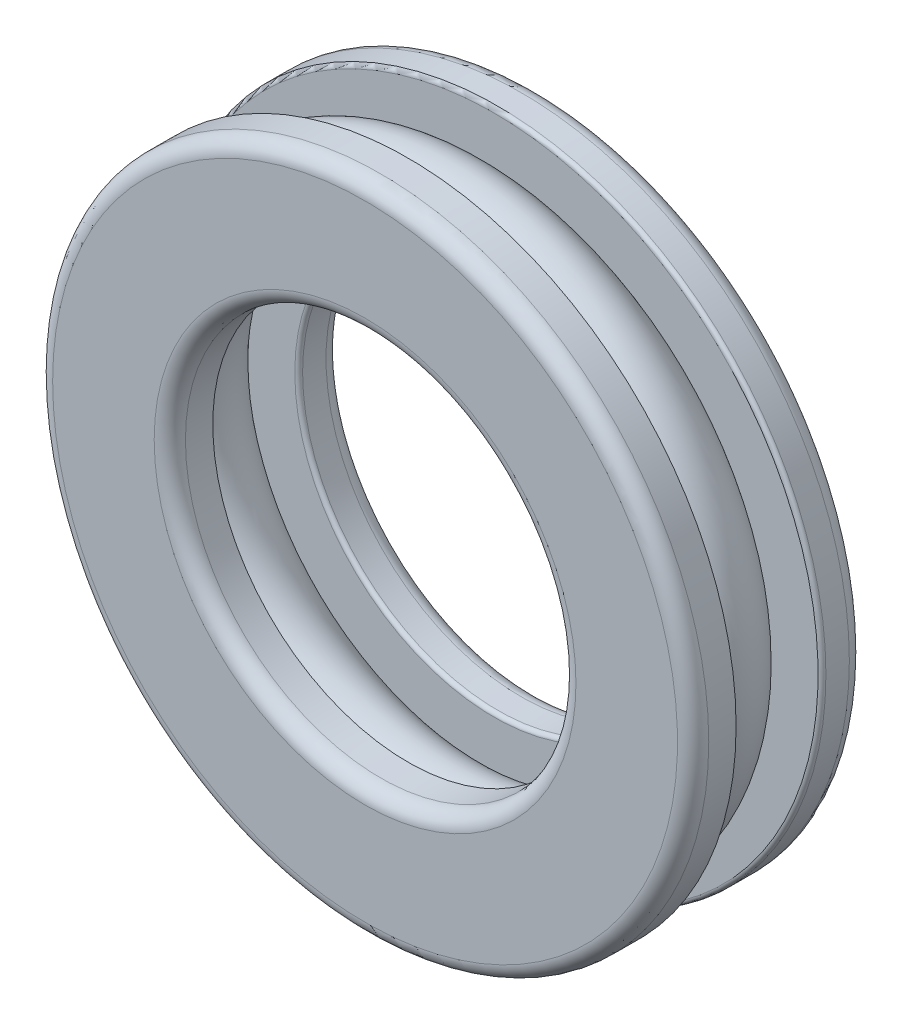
ISO-10303-21;
HEADER;
FILE_DESCRIPTION(('STEP AP214'),'2;1');
FILE_NAME('part.step','',(''),(''),'','','');
FILE_SCHEMA(('AUTOMOTIVE_DESIGN { 1 0 10303 214 1 1 1 1 }'));
ENDSEC;
DATA;
#1=APPLICATION_CONTEXT('core data for automotive mechanical design processes');
#2=APPLICATION_PROTOCOL_DEFINITION('international standard','automotive_design',2000,#1);
#3=PRODUCT_CONTEXT('',#1,'mechanical');
#4=PRODUCT('Part','Part','',(#3));
#5=PRODUCT_RELATED_PRODUCT_CATEGORY('part','',(#4));
#6=PRODUCT_DEFINITION_FORMATION('','',#4);
#7=PRODUCT_DEFINITION_CONTEXT('part definition',#1,'design');
#8=PRODUCT_DEFINITION('design','',#6,#7);
#9=PRODUCT_DEFINITION_SHAPE('','',#8);
#10=(LENGTH_UNIT() NAMED_UNIT(*) SI_UNIT(.MILLI.,.METRE.));
#11=(NAMED_UNIT(*) PLANE_ANGLE_UNIT() SI_UNIT($,.RADIAN.));
#12=(NAMED_UNIT(*) SI_UNIT($,.STERADIAN.) SOLID_ANGLE_UNIT());
#13=UNCERTAINTY_MEASURE_WITH_UNIT(LENGTH_MEASURE(1.E-05),#10,'distance_accuracy_value','');
#14=(GEOMETRIC_REPRESENTATION_CONTEXT(3) GLOBAL_UNCERTAINTY_ASSIGNED_CONTEXT((#13)) GLOBAL_UNIT_ASSIGNED_CONTEXT((#10,
#11,#12)) REPRESENTATION_CONTEXT('',''));
#15=CARTESIAN_POINT('',(0.,0.,0.));
#16=DIRECTION('',(0.,0.,1.));
#17=DIRECTION('',(1.,0.,0.));
#18=AXIS2_PLACEMENT_3D('',#15,#16,#17);
#19=CARTESIAN_POINT('',(0.,0.,-5.5));
#20=DIRECTION('',(0.,0.,1.));
#21=DIRECTION('',(1.,0.,0.));
#22=AXIS2_PLACEMENT_3D('',#19,#20,#21);
#23=TOROIDAL_SURFACE('',#22,16.75,2.65);
#24=CARTESIAN_POINT('',(19.4,0.,-5.5));
#25=VERTEX_POINT('',#24);
#26=VERTEX_LOOP('',#25);
#27=FACE_BOUND('',#26,.T.);
#28=ADVANCED_FACE('F39',(#27),#23,.T.);
#29=CLOSED_SHELL('',(#28));
#30=MANIFOLD_SOLID_BREP('B2',#29);
#31=CARTESIAN_POINT('',(0.,0.,0.));
#32=DIRECTION('',(0.,0.,1.));
#33=DIRECTION('',(1.,0.,0.));
#34=AXIS2_PLACEMENT_3D('',#31,#32,#33);
#35=CYLINDRICAL_SURFACE('',#34,21.);
#36=CARTESIAN_POINT('',(0.,0.,-8.5));
#37=DIRECTION('',(0.,0.,-1.));
#38=DIRECTION('',(-1.,0.,0.));
#39=AXIS2_PLACEMENT_3D('',#36,#37,#38);
#40=CIRCLE('',#39,21.);
#41=CARTESIAN_POINT('',(-21.,0.,-8.5));
#42=VERTEX_POINT('',#41);
#43=EDGE_CURVE('E66',#42,#42,#40,.T.);
#44=ORIENTED_EDGE('',*,*,#43,.T.);
#45=EDGE_LOOP('',(#44));
#46=FACE_BOUND('',#45,.T.);
#47=CARTESIAN_POINT('',(0.,0.,-10.));
#48=DIRECTION('',(0.,0.,1.));
#49=DIRECTION('',(1.,0.,0.));
#50=AXIS2_PLACEMENT_3D('',#47,#48,#49);
#51=CIRCLE('',#50,21.);
#52=CARTESIAN_POINT('',(21.,0.,-10.));
#53=VERTEX_POINT('',#52);
#54=EDGE_CURVE('E79',#53,#53,#51,.T.);
#55=ORIENTED_EDGE('',*,*,#54,.T.);
#56=EDGE_LOOP('',(#55));
#57=FACE_BOUND('',#56,.T.);
#58=ADVANCED_FACE('F59',(#46,#57),#35,.T.);
#59=CARTESIAN_POINT('',(-21.,0.,-8.25));
#60=DIRECTION('',(0.,0.,-1.));
#61=DIRECTION('',(-1.,0.,0.));
#62=AXIS2_PLACEMENT_3D('',#59,#60,#61);
#63=PLANE('',#62);
#64=CARTESIAN_POINT('',(0.,0.,-8.25));
#65=DIRECTION('',(0.,0.,-1.));
#66=DIRECTION('',(-1.,0.,0.));
#67=AXIS2_PLACEMENT_3D('',#64,#65,#66);
#68=CIRCLE('',#67,20.75);
#69=CARTESIAN_POINT('',(-20.75,0.,-8.25));
#70=VERTEX_POINT('',#69);
#71=EDGE_CURVE('E70',#70,#70,#68,.F.);
#72=ORIENTED_EDGE('',*,*,#71,.T.);
#73=EDGE_LOOP('',(#72));
#74=FACE_BOUND('',#73,.T.);
#75=CARTESIAN_POINT('',(0.,0.,-8.25));
#76=DIRECTION('',(0.,0.,-1.));
#77=DIRECTION('',(-1.,0.,0.));
#78=AXIS2_PLACEMENT_3D('',#75,#76,#77);
#79=CIRCLE('',#78,12.75);
#80=CARTESIAN_POINT('',(-12.75,0.,-8.25));
#81=VERTEX_POINT('',#80);
#82=EDGE_CURVE('E74',#81,#81,#79,.T.);
#83=ORIENTED_EDGE('',*,*,#82,.T.);
#84=EDGE_LOOP('',(#83));
#85=FACE_BOUND('',#84,.T.);
#86=ADVANCED_FACE('F103',(#74,#85),#63,.F.);
#87=CARTESIAN_POINT('',(0.,0.,0.));
#88=DIRECTION('',(0.,0.,1.));
#89=DIRECTION('',(1.,0.,0.));
#90=AXIS2_PLACEMENT_3D('',#87,#88,#89);
#91=CYLINDRICAL_SURFACE('',#90,12.5);
#92=CARTESIAN_POINT('',(0.,0.,-8.5));
#93=DIRECTION('',(0.,0.,-1.));
#94=DIRECTION('',(-1.,0.,0.));
#95=AXIS2_PLACEMENT_3D('',#92,#93,#94);
#96=CIRCLE('',#95,12.5);
#97=CARTESIAN_POINT('',(-12.5,0.,-8.5));
#98=VERTEX_POINT('',#97);
#99=EDGE_CURVE('E38',#98,#98,#96,.F.);
#100=ORIENTED_EDGE('',*,*,#99,.T.);
#101=EDGE_LOOP('',(#100));
#102=FACE_BOUND('',#101,.T.);
#103=CARTESIAN_POINT('',(0.,0.,-10.));
#104=DIRECTION('',(0.,0.,1.));
#105=DIRECTION('',(1.,0.,0.));
#106=AXIS2_PLACEMENT_3D('',#103,#104,#105);
#107=CIRCLE('',#106,12.5);
#108=CARTESIAN_POINT('',(12.5,0.,-10.));
#109=VERTEX_POINT('',#108);
#110=EDGE_CURVE('E82',#109,#109,#107,.F.);
#111=ORIENTED_EDGE('',*,*,#110,.T.);
#112=EDGE_LOOP('',(#111));
#113=FACE_BOUND('',#112,.T.);
#114=ADVANCED_FACE('F109',(#102,#113),#91,.F.);
#115=CARTESIAN_POINT('',(-21.,0.,-11.));
#116=DIRECTION('',(0.,0.,1.));
#117=DIRECTION('',(1.,0.,0.));
#118=AXIS2_PLACEMENT_3D('',#115,#116,#117);
#119=PLANE('',#118);
#120=CARTESIAN_POINT('',(0.,0.,-11.));
#121=DIRECTION('',(0.,0.,1.));
#122=DIRECTION('',(1.,0.,0.));
#123=AXIS2_PLACEMENT_3D('',#120,#121,#122);
#124=CIRCLE('',#123,13.5);
#125=CARTESIAN_POINT('',(13.5,0.,-11.));
#126=VERTEX_POINT('',#125);
#127=EDGE_CURVE('E85',#126,#126,#124,.T.);
#128=ORIENTED_EDGE('',*,*,#127,.T.);
#129=EDGE_LOOP('',(#128));
#130=FACE_BOUND('',#129,.T.);
#131=CARTESIAN_POINT('',(0.,0.,-11.));
#132=DIRECTION('',(0.,0.,1.));
#133=DIRECTION('',(1.,0.,0.));
#134=AXIS2_PLACEMENT_3D('',#131,#132,#133);
#135=CIRCLE('',#134,20.);
#136=CARTESIAN_POINT('',(20.,0.,-11.));
#137=VERTEX_POINT('',#136);
#138=EDGE_CURVE('E88',#137,#137,#135,.F.);
#139=ORIENTED_EDGE('',*,*,#138,.T.);
#140=EDGE_LOOP('',(#139));
#141=FACE_BOUND('',#140,.T.);
#142=ADVANCED_FACE('F92',(#130,#141),#119,.F.);
#143=CARTESIAN_POINT('',(0.,0.,-10.));
#144=DIRECTION('',(0.,0.,1.));
#145=DIRECTION('',(1.,0.,0.));
#146=AXIS2_PLACEMENT_3D('',#143,#144,#145);
#147=TOROIDAL_SURFACE('',#146,13.5,1.);
#148=ORIENTED_EDGE('',*,*,#110,.F.);
#149=EDGE_LOOP('',(#148));
#150=FACE_BOUND('',#149,.T.);
#151=ORIENTED_EDGE('',*,*,#127,.F.);
#152=EDGE_LOOP('',(#151));
#153=FACE_BOUND('',#152,.T.);
#154=ADVANCED_FACE('F98',(#150,#153),#147,.T.);
#155=CARTESIAN_POINT('',(0.,0.,-10.));
#156=DIRECTION('',(0.,0.,1.));
#157=DIRECTION('',(1.,0.,0.));
#158=AXIS2_PLACEMENT_3D('',#155,#156,#157);
#159=TOROIDAL_SURFACE('',#158,20.,1.);
#160=ORIENTED_EDGE('',*,*,#138,.F.);
#161=EDGE_LOOP('',(#160));
#162=FACE_BOUND('',#161,.T.);
#163=ORIENTED_EDGE('',*,*,#54,.F.);
#164=EDGE_LOOP('',(#163));
#165=FACE_BOUND('',#164,.T.);
#166=ADVANCED_FACE('F94',(#162,#165),#159,.T.);
#167=CARTESIAN_POINT('',(0.,0.,-8.5));
#168=DIRECTION('',(0.,0.,-1.));
#169=DIRECTION('',(-1.,0.,0.));
#170=AXIS2_PLACEMENT_3D('',#167,#168,#169);
#171=TOROIDAL_SURFACE('',#170,20.75,0.25);
#172=ORIENTED_EDGE('',*,*,#43,.F.);
#173=EDGE_LOOP('',(#172));
#174=FACE_BOUND('',#173,.T.);
#175=ORIENTED_EDGE('',*,*,#71,.F.);
#176=EDGE_LOOP('',(#175));
#177=FACE_BOUND('',#176,.T.);
#178=ADVANCED_FACE('F97',(#174,#177),#171,.T.);
#179=CARTESIAN_POINT('',(0.,0.,-8.5));
#180=DIRECTION('',(0.,0.,-1.));
#181=DIRECTION('',(-1.,0.,0.));
#182=AXIS2_PLACEMENT_3D('',#179,#180,#181);
#183=TOROIDAL_SURFACE('',#182,12.75,0.25);
#184=ORIENTED_EDGE('',*,*,#82,.F.);
#185=EDGE_LOOP('',(#184));
#186=FACE_BOUND('',#185,.T.);
#187=ORIENTED_EDGE('',*,*,#99,.F.);
#188=EDGE_LOOP('',(#187));
#189=FACE_BOUND('',#188,.T.);
#190=ADVANCED_FACE('F61',(#186,#189),#183,.T.);
#191=CLOSED_SHELL('',(#58,#86,#114,#142,#154,#166,#178,#190));
#192=MANIFOLD_SOLID_BREP('B6',#191);
#193=CARTESIAN_POINT('',(0.,0.,0.));
#194=DIRECTION('',(0.,0.,1.));
#195=DIRECTION('',(1.,0.,0.));
#196=AXIS2_PLACEMENT_3D('',#193,#194,#195);
#197=CYLINDRICAL_SURFACE('',#196,21.);
#198=CARTESIAN_POINT('',(0.,0.,-1.));
#199=DIRECTION('',(0.,0.,-1.));
#200=DIRECTION('',(-1.,0.,0.));
#201=AXIS2_PLACEMENT_3D('',#198,#199,#200);
#202=CIRCLE('',#201,21.);
#203=CARTESIAN_POINT('',(-21.,0.,-1.));
#204=VERTEX_POINT('',#203);
#205=EDGE_CURVE('E187',#204,#204,#202,.T.);
#206=ORIENTED_EDGE('',*,*,#205,.T.);
#207=EDGE_LOOP('',(#206));
#208=FACE_BOUND('',#207,.T.);
#209=CARTESIAN_POINT('',(0.,0.,-2.75));
#210=DIRECTION('',(0.,0.,1.));
#211=DIRECTION('',(1.,0.,0.));
#212=AXIS2_PLACEMENT_3D('',#209,#210,#211);
#213=CIRCLE('',#212,21.);
#214=CARTESIAN_POINT('',(21.,0.,-2.75));
#215=VERTEX_POINT('',#214);
#216=EDGE_CURVE('E200',#215,#215,#213,.T.);
#217=ORIENTED_EDGE('',*,*,#216,.T.);
#218=EDGE_LOOP('',(#217));
#219=FACE_BOUND('',#218,.T.);
#220=ADVANCED_FACE('F180',(#208,#219),#197,.T.);
#221=CARTESIAN_POINT('',(-21.,0.,-2.75));
#222=DIRECTION('',(0.,0.,1.));
#223=DIRECTION('',(1.,0.,0.));
#224=AXIS2_PLACEMENT_3D('',#221,#222,#223);
#225=PLANE('',#224);
#226=ORIENTED_EDGE('',*,*,#216,.F.);
#227=EDGE_LOOP('',(#226));
#228=FACE_BOUND('',#227,.T.);
#229=CARTESIAN_POINT('',(0.,0.,-2.75));
#230=DIRECTION('',(0.,0.,1.));
#231=DIRECTION('',(1.,0.,0.));
#232=AXIS2_PLACEMENT_3D('',#229,#230,#231);
#233=CIRCLE('',#232,12.5);
#234=CARTESIAN_POINT('',(12.5,0.,-2.75));
#235=VERTEX_POINT('',#234);
#236=EDGE_CURVE('E203',#235,#235,#233,.T.);
#237=ORIENTED_EDGE('',*,*,#236,.T.);
#238=EDGE_LOOP('',(#237));
#239=FACE_BOUND('',#238,.T.);
#240=ADVANCED_FACE('F207',(#228,#239),#225,.F.);
#241=CARTESIAN_POINT('',(0.,0.,0.));
#242=DIRECTION('',(0.,0.,1.));
#243=DIRECTION('',(1.,0.,0.));
#244=AXIS2_PLACEMENT_3D('',#241,#242,#243);
#245=CYLINDRICAL_SURFACE('',#244,12.5);
#246=CARTESIAN_POINT('',(0.,0.,-1.));
#247=DIRECTION('',(0.,0.,-1.));
#248=DIRECTION('',(-1.,0.,0.));
#249=AXIS2_PLACEMENT_3D('',#246,#247,#248);
#250=CIRCLE('',#249,12.5);
#251=CARTESIAN_POINT('',(-12.5,0.,-1.));
#252=VERTEX_POINT('',#251);
#253=EDGE_CURVE('E58',#252,#252,#250,.F.);
#254=ORIENTED_EDGE('',*,*,#253,.T.);
#255=EDGE_LOOP('',(#254));
#256=FACE_BOUND('',#255,.T.);
#257=ORIENTED_EDGE('',*,*,#236,.F.);
#258=EDGE_LOOP('',(#257));
#259=FACE_BOUND('',#258,.T.);
#260=ADVANCED_FACE('F209',(#256,#259),#245,.F.);
#261=CARTESIAN_POINT('',(-21.,0.,0.));
#262=DIRECTION('',(0.,0.,-1.));
#263=DIRECTION('',(-1.,0.,0.));
#264=AXIS2_PLACEMENT_3D('',#261,#262,#263);
#265=PLANE('',#264);
#266=CARTESIAN_POINT('',(0.,0.,0.));
#267=DIRECTION('',(0.,0.,-1.));
#268=DIRECTION('',(-1.,0.,0.));
#269=AXIS2_PLACEMENT_3D('',#266,#267,#268);
#270=CIRCLE('',#269,20.);
#271=CARTESIAN_POINT('',(-20.,0.,0.));
#272=VERTEX_POINT('',#271);
#273=EDGE_CURVE('E191',#272,#272,#270,.F.);
#274=ORIENTED_EDGE('',*,*,#273,.T.);
#275=EDGE_LOOP('',(#274));
#276=FACE_BOUND('',#275,.T.);
#277=CARTESIAN_POINT('',(0.,0.,0.));
#278=DIRECTION('',(0.,0.,-1.));
#279=DIRECTION('',(-1.,0.,0.));
#280=AXIS2_PLACEMENT_3D('',#277,#278,#279);
#281=CIRCLE('',#280,13.5);
#282=CARTESIAN_POINT('',(-13.5,0.,0.));
#283=VERTEX_POINT('',#282);
#284=EDGE_CURVE('E195',#283,#283,#281,.T.);
#285=ORIENTED_EDGE('',*,*,#284,.T.);
#286=EDGE_LOOP('',(#285));
#287=FACE_BOUND('',#286,.T.);
#288=ADVANCED_FACE('F211',(#276,#287),#265,.F.);
#289=CARTESIAN_POINT('',(0.,0.,-1.));
#290=DIRECTION('',(0.,0.,-1.));
#291=DIRECTION('',(-1.,0.,0.));
#292=AXIS2_PLACEMENT_3D('',#289,#290,#291);
#293=TOROIDAL_SURFACE('',#292,20.,1.);
#294=ORIENTED_EDGE('',*,*,#205,.F.);
#295=EDGE_LOOP('',(#294));
#296=FACE_BOUND('',#295,.T.);
#297=ORIENTED_EDGE('',*,*,#273,.F.);
#298=EDGE_LOOP('',(#297));
#299=FACE_BOUND('',#298,.T.);
#300=ADVANCED_FACE('F217',(#296,#299),#293,.T.);
#301=CARTESIAN_POINT('',(0.,0.,-1.));
#302=DIRECTION('',(0.,0.,-1.));
#303=DIRECTION('',(-1.,0.,0.));
#304=AXIS2_PLACEMENT_3D('',#301,#302,#303);
#305=TOROIDAL_SURFACE('',#304,13.5,1.);
#306=ORIENTED_EDGE('',*,*,#284,.F.);
#307=EDGE_LOOP('',(#306));
#308=FACE_BOUND('',#307,.T.);
#309=ORIENTED_EDGE('',*,*,#253,.F.);
#310=EDGE_LOOP('',(#309));
#311=FACE_BOUND('',#310,.T.);
#312=ADVANCED_FACE('F182',(#308,#311),#305,.T.);
#313=CLOSED_SHELL('',(#220,#240,#260,#288,#300,#312));
#314=MANIFOLD_SOLID_BREP('B33',#313);
#315=ADVANCED_BREP_SHAPE_REPRESENTATION('',(#18,#30,#192,#314),#14);
#316=SHAPE_DEFINITION_REPRESENTATION(#9,#315);
ENDSEC;
END-ISO-10303-21;
